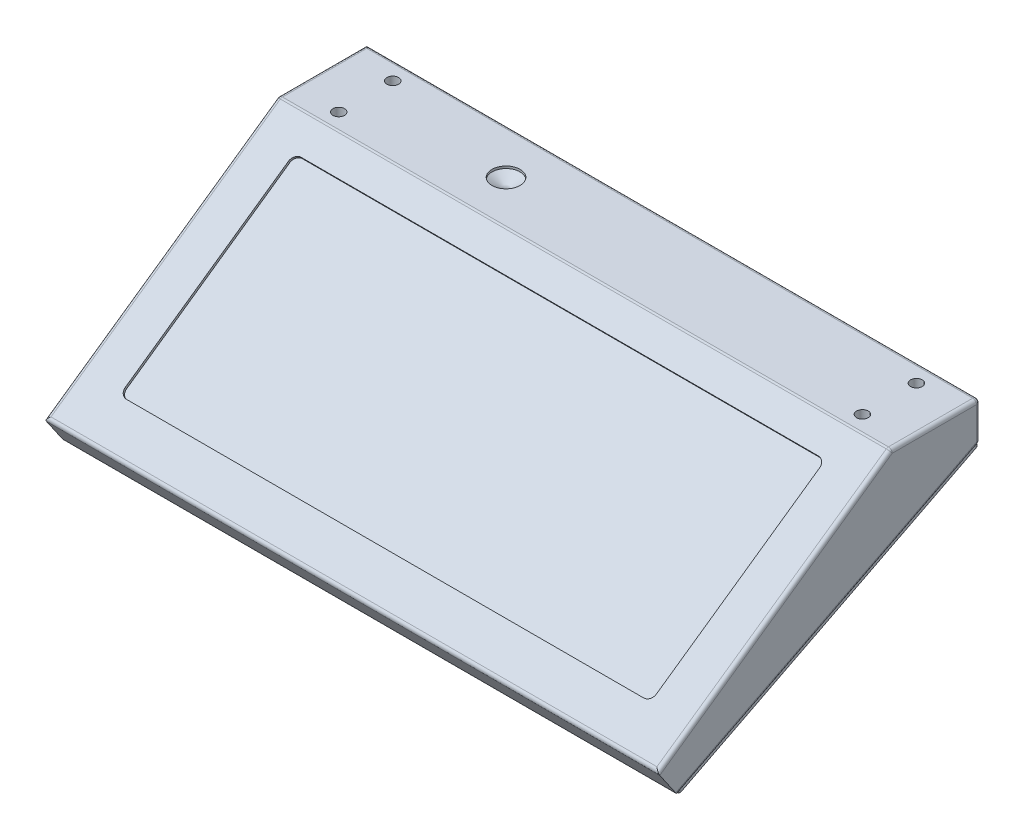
from build123d import *

# Parameters (mm, degrees)
ENCLOSURE_BODY_DEPTH    = 208.28
RADII_R                 = 2.54
KEYS_EXTRUDE_DEPTH      = 1.6002
SUB_PANEL_EMBOSS_DEPTH  = 2.286
MOUNTING_HOLES_D        = 7.9375
CABLE_ACCESS_HOLE_D     = 19.05
CABLE_ACCESS_HOLE_DEPTH = 1.524
CABLE_ACCESS_HOLE_TIP   = 5.723197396


with BuildPart() as part:
    # Sketch2 → Enclosure Body (new, symmetric)
    with BuildSketch(Plane(origin=(0, 0, 0), x_dir=(0, 0, -1), z_dir=(1, 0, 0))):
        Polygon((0, 0), (-60.579, 0), (-219.04101402, -110.956296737), (-205.337324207, -130.786592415), (0, -26.162), align=None)
    extrude(amount=ENCLOSURE_BODY_DEPTH, both=True)

    # Radii
    radii_edges = [part.edges().sort_by_distance(p)[0] for p in [
        (208.28, -55.478148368, 139.81000701),
        (208.28, -78.474296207, 102.668662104),
        (208.28, -13.081, 0),
        (-208.28, -78.474296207, 102.668662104),
        (-208.28, -55.478148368, 139.81000701),
        (-208.28, 0, 30.2895),
        (208.28, 0, 30.2895),
        (0, -26.162, 0),
        (0, -130.786592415, 205.337324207),
        (0, -110.956296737, 219.04101402),
        (0, 0, 60.579),
        (0, 0, 0),
    ]]
    fillet(radii_edges, radius=RADII_R)

    # Sketch3 → Keys Extrude (cut)
    with BuildSketch(Plane(origin=(0, 28.462819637, 19.929880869), x_dir=(1, 0, 0), z_dir=(0, 0.819152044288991, 0.5735764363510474))):
        with BuildLine():
            Line((-175.5648, -69.958993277), (175.5648, -69.958993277))
            ThreePointArc((175.5648, -69.958993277), (178.941376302, -71.357616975), (180.34, -74.734193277))
            Line((180.34, -74.734193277), (180.34, -209.963793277))
            ThreePointArc((180.34, -209.963793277), (178.941376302, -213.340369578), (175.5648, -214.738993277))
            Line((175.5648, -214.738993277), (-175.5648, -214.738993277))
            ThreePointArc((-175.5648, -214.738993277), (-178.941376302, -213.340369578), (-180.34, -209.963793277))
            Line((-180.34, -209.963793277), (-180.34, -74.734193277))
            ThreePointArc((-180.34, -74.734193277), (-178.941376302, -71.357616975), (-175.5648, -69.958993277))
        make_face()
    extrude(amount=-KEYS_EXTRUDE_DEPTH, mode=Mode.SUBTRACT)

    # Sketch4 → Sub-panel Emboss (add)
    with BuildSketch(Plane(origin=(0, -20.769818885, -10.582751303), x_dir=(1, 0, 0), z_dir=(0, -0.891006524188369, -0.4539904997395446))):
        with BuildLine():
            Line((-205.232, 240.610935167), (205.232, 240.610935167))
            ThreePointArc((205.232, 240.610935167), (206.309630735, 240.164565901), (206.756, 239.086935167))
            Line((206.756, 239.086935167), (206.756, 14.169935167))
            ThreePointArc((206.756, 14.169935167), (206.309630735, 13.092304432), (205.232, 12.645935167))
            Line((205.232, 12.645935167), (-205.232, 12.645935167))
            ThreePointArc((-205.232, 12.645935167), (-206.309630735, 13.092304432), (-206.756, 14.169935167))
            Line((-206.756, 14.169935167), (-206.756, 239.086935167))
            ThreePointArc((-206.756, 239.086935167), (-206.309630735, 240.164565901), (-205.232, 240.610935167))
        make_face()
    extrude(amount=SUB_PANEL_EMBOSS_DEPTH)

    # Mounting Holes (through all)
    with Locations(Plane(origin=(0, 0, 0), x_dir=(1, 0, 0), z_dir=(0, 1, 0))):
        with Locations((-177.8, -12.820270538), (-177.8, -49.497870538), (177.8, -49.497870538), (177.8, -12.820270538)):
            Hole(MOUNTING_HOLES_D / 2)

    # Cable Access Hole
    with Locations(Plane(origin=(0, 0, 0), x_dir=(1, 0, 0), z_dir=(0, 1, 0))):
        with Locations((-82.55, -31.159070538)):
            Hole(CABLE_ACCESS_HOLE_D / 2, depth=CABLE_ACCESS_HOLE_DEPTH)
            with Locations((0, 0, -(CABLE_ACCESS_HOLE_DEPTH + CABLE_ACCESS_HOLE_TIP / 2))):  # 118° drill point
                Cone(0, CABLE_ACCESS_HOLE_D / 2, CABLE_ACCESS_HOLE_TIP, mode=Mode.SUBTRACT)


solid = part.part
